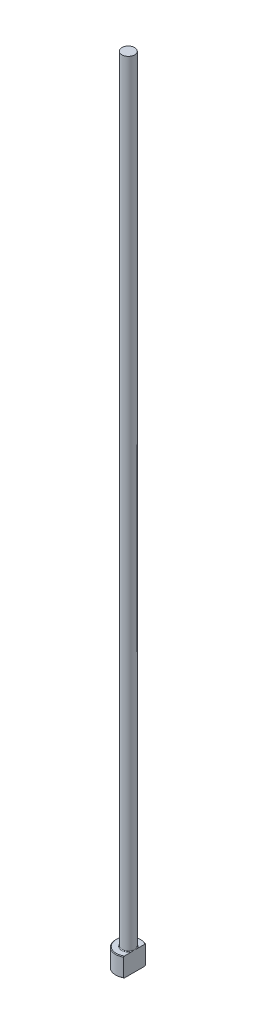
ISO-10303-21;
HEADER;
FILE_DESCRIPTION(('STEP AP214'),'2;1');
FILE_NAME('part.step','',(''),(''),'','','');
FILE_SCHEMA(('AUTOMOTIVE_DESIGN { 1 0 10303 214 1 1 1 1 }'));
ENDSEC;
DATA;
#1=APPLICATION_CONTEXT('core data for automotive mechanical design processes');
#2=APPLICATION_PROTOCOL_DEFINITION('international standard','automotive_design',2000,#1);
#3=PRODUCT_CONTEXT('',#1,'mechanical');
#4=PRODUCT('Part','Part','',(#3));
#5=PRODUCT_RELATED_PRODUCT_CATEGORY('part','',(#4));
#6=PRODUCT_DEFINITION_FORMATION('','',#4);
#7=PRODUCT_DEFINITION_CONTEXT('part definition',#1,'design');
#8=PRODUCT_DEFINITION('design','',#6,#7);
#9=PRODUCT_DEFINITION_SHAPE('','',#8);
#10=(LENGTH_UNIT() NAMED_UNIT(*) SI_UNIT(.MILLI.,.METRE.));
#11=(NAMED_UNIT(*) PLANE_ANGLE_UNIT() SI_UNIT($,.RADIAN.));
#12=(NAMED_UNIT(*) SI_UNIT($,.STERADIAN.) SOLID_ANGLE_UNIT());
#13=UNCERTAINTY_MEASURE_WITH_UNIT(LENGTH_MEASURE(1.E-05),#10,'distance_accuracy_value','');
#14=(GEOMETRIC_REPRESENTATION_CONTEXT(3) GLOBAL_UNCERTAINTY_ASSIGNED_CONTEXT((#13)) GLOBAL_UNIT_ASSIGNED_CONTEXT((#10,
#11,#12)) REPRESENTATION_CONTEXT('',''));
#15=CARTESIAN_POINT('',(0.,0.,0.));
#16=DIRECTION('',(0.,0.,1.));
#17=DIRECTION('',(1.,0.,0.));
#18=AXIS2_PLACEMENT_3D('',#15,#16,#17);
#19=CARTESIAN_POINT('',(0.,0.,0.));
#20=DIRECTION('',(0.,-1.,0.));
#21=DIRECTION('',(0.,0.,-1.));
#22=AXIS2_PLACEMENT_3D('',#19,#20,#21);
#23=PLANE('',#22);
#24=CARTESIAN_POINT('',(0.,0.,0.));
#25=DIRECTION('',(0.,-1.,0.));
#26=DIRECTION('',(0.,0.,-1.));
#27=AXIS2_PLACEMENT_3D('',#24,#25,#26);
#28=CIRCLE('',#27,3.79999999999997);
#29=CARTESIAN_POINT('',(1.99999999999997,0.,3.23109888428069));
#30=VERTEX_POINT('',#29);
#31=CARTESIAN_POINT('',(1.99999999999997,0.,-3.23109888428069));
#32=VERTEX_POINT('',#31);
#33=EDGE_CURVE('E98',#30,#32,#28,.T.);
#34=ORIENTED_EDGE('',*,*,#33,.T.);
#35=DIRECTION('',(0.,0.,1.));
#36=VECTOR('',#35,1.);
#37=CARTESIAN_POINT('',(1.99999999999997,0.,3.46410161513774));
#38=LINE('',#37,#36);
#39=EDGE_CURVE('E83',#32,#30,#38,.T.);
#40=ORIENTED_EDGE('',*,*,#39,.T.);
#41=EDGE_LOOP('',(#34,#40));
#42=FACE_BOUND('',#41,.T.);
#43=ADVANCED_FACE('F32',(#42),#23,.T.);
#44=CARTESIAN_POINT('',(0.,259.958771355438,0.));
#45=DIRECTION('',(0.,1.,0.));
#46=DIRECTION('',(0.,0.,1.));
#47=AXIS2_PLACEMENT_3D('',#44,#45,#46);
#48=CYLINDRICAL_SURFACE('',#47,3.99999999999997);
#49=CARTESIAN_POINT('',(0.,5.79999999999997,0.));
#50=DIRECTION('',(0.,1.,0.));
#51=DIRECTION('',(0.,0.,1.));
#52=AXIS2_PLACEMENT_3D('',#49,#50,#51);
#53=CIRCLE('',#52,3.99999999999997);
#54=CARTESIAN_POINT('',(1.99999999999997,5.79999999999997,3.46410161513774));
#55=VERTEX_POINT('',#54);
#56=CARTESIAN_POINT('',(1.99999999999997,5.79999999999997,-3.46410161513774));
#57=VERTEX_POINT('',#56);
#58=EDGE_CURVE('E104',#55,#57,#53,.F.);
#59=ORIENTED_EDGE('',*,*,#58,.T.);
#60=DIRECTION('',(0.,-1.,0.));
#61=VECTOR('',#60,1.);
#62=CARTESIAN_POINT('',(1.99999999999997,250.,-3.46410161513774));
#63=LINE('',#62,#61);
#64=CARTESIAN_POINT('',(1.99999999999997,0.200000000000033,-3.46410161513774));
#65=VERTEX_POINT('',#64);
#66=EDGE_CURVE('E183',#57,#65,#63,.T.);
#67=ORIENTED_EDGE('',*,*,#66,.T.);
#68=CARTESIAN_POINT('',(0.,0.200000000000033,0.));
#69=DIRECTION('',(0.,-1.,0.));
#70=DIRECTION('',(0.,0.,-1.));
#71=AXIS2_PLACEMENT_3D('',#68,#69,#70);
#72=CIRCLE('',#71,3.99999999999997);
#73=CARTESIAN_POINT('',(1.99999999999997,0.200000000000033,3.46410161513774));
#74=VERTEX_POINT('',#73);
#75=EDGE_CURVE('E100',#65,#74,#72,.F.);
#76=ORIENTED_EDGE('',*,*,#75,.T.);
#77=DIRECTION('',(0.,-1.,0.));
#78=VECTOR('',#77,1.);
#79=CARTESIAN_POINT('',(1.99999999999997,250.,3.46410161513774));
#80=LINE('',#79,#78);
#81=EDGE_CURVE('E93',#55,#74,#80,.T.);
#82=ORIENTED_EDGE('',*,*,#81,.F.);
#83=EDGE_LOOP('',(#59,#67,#76,#82));
#84=FACE_BOUND('',#83,.T.);
#85=ADVANCED_FACE('F158',(#84),#48,.T.);
#86=CARTESIAN_POINT('',(-3.99999999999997,6.,0.));
#87=DIRECTION('',(0.,1.,0.));
#88=DIRECTION('',(0.,0.,1.));
#89=AXIS2_PLACEMENT_3D('',#86,#87,#88);
#90=PLANE('',#89);
#91=CARTESIAN_POINT('',(0.,6.,0.));
#92=DIRECTION('',(0.,1.,0.));
#93=DIRECTION('',(0.,0.,1.));
#94=AXIS2_PLACEMENT_3D('',#91,#92,#93);
#95=CIRCLE('',#94,3.79999999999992);
#96=CARTESIAN_POINT('',(1.99999999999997,6.,-3.23109888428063));
#97=VERTEX_POINT('',#96);
#98=CARTESIAN_POINT('',(1.99999999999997,6.,3.23109888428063));
#99=VERTEX_POINT('',#98);
#100=EDGE_CURVE('E178',#97,#99,#95,.T.);
#101=ORIENTED_EDGE('',*,*,#100,.T.);
#102=DIRECTION('',(0.,0.,-1.));
#103=VECTOR('',#102,1.);
#104=CARTESIAN_POINT('',(1.99999999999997,6.,0.));
#105=LINE('',#104,#103);
#106=CARTESIAN_POINT('',(1.99999999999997,5.99999999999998,0.916515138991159));
#107=VERTEX_POINT('',#106);
#108=EDGE_CURVE('E57',#99,#107,#105,.T.);
#109=ORIENTED_EDGE('',*,*,#108,.T.);
#110=CARTESIAN_POINT('',(0.,6.,0.));
#111=DIRECTION('',(0.,1.,0.));
#112=DIRECTION('',(0.,0.,1.));
#113=AXIS2_PLACEMENT_3D('',#110,#111,#112);
#114=CIRCLE('',#113,2.19999999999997);
#115=CARTESIAN_POINT('',(1.99999999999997,5.99999999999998,-0.916515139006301));
#116=VERTEX_POINT('',#115);
#117=EDGE_CURVE('E107',#107,#116,#114,.F.);
#118=ORIENTED_EDGE('',*,*,#117,.T.);
#119=EDGE_CURVE('E136',#116,#97,#105,.T.);
#120=ORIENTED_EDGE('',*,*,#119,.T.);
#121=EDGE_LOOP('',(#101,#109,#118,#120));
#122=FACE_BOUND('',#121,.T.);
#123=ADVANCED_FACE('F147',(#122),#90,.T.);
#124=CARTESIAN_POINT('',(0.,6.00000000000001,0.));
#125=DIRECTION('',(0.,-1.,0.));
#126=DIRECTION('',(0.,0.,-1.));
#127=AXIS2_PLACEMENT_3D('',#124,#125,#126);
#128=CONICAL_SURFACE('',#127,3.79999999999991,0.785398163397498);
#129=ORIENTED_EDGE('',*,*,#58,.F.);
#130=CARTESIAN_POINT('',(1.99999999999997,1.91904532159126,7.62295524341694));
#131=CARTESIAN_POINT('',(1.99999999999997,2.0861124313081,7.45022392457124));
#132=CARTESIAN_POINT('',(1.99999999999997,2.25300024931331,7.27731861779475));
#133=CARTESIAN_POINT('',(1.99999999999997,2.58631125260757,6.93105655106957));
#134=CARTESIAN_POINT('',(1.99999999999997,2.75273443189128,6.75769978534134));
#135=CARTESIAN_POINT('',(1.99999999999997,3.08509080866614,6.4103469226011));
#136=CARTESIAN_POINT('',(1.99999999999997,3.25102371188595,6.23635054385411));
#137=CARTESIAN_POINT('',(1.99999999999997,3.58215598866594,5.88766284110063));
#138=CARTESIAN_POINT('',(1.99999999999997,3.74735536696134,5.71297152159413));
#139=CARTESIAN_POINT('',(1.99999999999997,4.0735385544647,5.36616839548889));
#140=CARTESIAN_POINT('',(1.99999999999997,4.23454099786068,5.19407412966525));
#141=CARTESIAN_POINT('',(1.99999999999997,4.55534102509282,4.84876663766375));
#142=CARTESIAN_POINT('',(1.99999999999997,4.7151386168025,4.67555341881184));
#143=CARTESIAN_POINT('',(1.99999999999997,5.03306183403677,4.32766569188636));
#144=CARTESIAN_POINT('',(1.99999999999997,5.19118781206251,4.15299150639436));
#145=CARTESIAN_POINT('',(1.99999999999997,5.50513944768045,3.80159134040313));
#146=CARTESIAN_POINT('',(1.99999999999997,5.66096519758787,3.62486544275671));
#147=CARTESIAN_POINT('',(1.99999999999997,5.90974646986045,3.33722425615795));
#148=CARTESIAN_POINT('',(1.99999999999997,6.00376148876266,3.22722645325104));
#149=CARTESIAN_POINT('',(1.99999999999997,6.19011825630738,3.00579987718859));
#150=CARTESIAN_POINT('',(1.99999999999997,6.28245983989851,2.89437096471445));
#151=CARTESIAN_POINT('',(1.99999999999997,6.46586188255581,2.66849662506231));
#152=CARTESIAN_POINT('',(1.99999999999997,6.55689849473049,2.55403176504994));
#153=CARTESIAN_POINT('',(1.99999999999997,6.7357880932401,2.32266819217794));
#154=CARTESIAN_POINT('',(1.99999999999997,6.82364184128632,2.20577007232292));
#155=CARTESIAN_POINT('',(1.99999999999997,6.9961275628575,1.96688707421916));
#156=CARTESIAN_POINT('',(1.99999999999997,7.08069035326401,1.84485190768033));
#157=CARTESIAN_POINT('',(1.99999999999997,7.24300264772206,1.59599329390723));
#158=CARTESIAN_POINT('',(1.99999999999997,7.32074277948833,1.4691635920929));
#159=CARTESIAN_POINT('',(1.99999999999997,7.42869763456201,1.27510066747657));
#160=CARTESIAN_POINT('',(1.99999999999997,7.46305374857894,1.21018943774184));
#161=CARTESIAN_POINT('',(1.99999999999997,7.5283714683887,1.07868835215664));
#162=CARTESIAN_POINT('',(1.99999999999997,7.55933245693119,1.01209819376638));
#163=CARTESIAN_POINT('',(1.99999999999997,7.64566860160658,0.809894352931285));
#164=CARTESIAN_POINT('',(1.99999999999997,7.69478214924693,0.671360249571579));
#165=CARTESIAN_POINT('',(1.99999999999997,7.74794829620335,0.463657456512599));
#166=CARTESIAN_POINT('',(1.99999999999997,7.76205065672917,0.397033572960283));
#167=CARTESIAN_POINT('',(1.99999999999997,7.78390371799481,0.262728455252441));
#168=CARTESIAN_POINT('',(1.99999999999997,7.7916549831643,0.195047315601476));
#169=CARTESIAN_POINT('',(1.99999999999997,7.80025690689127,0.0594528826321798));
#170=CARTESIAN_POINT('',(1.99999999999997,7.80112894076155,-0.00845903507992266));
#171=CARTESIAN_POINT('',(1.99999999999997,7.79596585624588,-0.144020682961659));
#172=CARTESIAN_POINT('',(1.99999999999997,7.78993016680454,-0.211670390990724));
#173=CARTESIAN_POINT('',(1.99999999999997,7.7714536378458,-0.345483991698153));
#174=CARTESIAN_POINT('',(1.99999999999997,7.75906777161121,-0.41165563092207));
#175=CARTESIAN_POINT('',(1.99999999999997,7.72866360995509,-0.54267826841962));
#176=CARTESIAN_POINT('',(1.99999999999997,7.71064463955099,-0.607529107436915));
#177=CARTESIAN_POINT('',(1.99999999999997,7.66972939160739,-0.736064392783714));
#178=CARTESIAN_POINT('',(1.99999999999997,7.64680564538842,-0.799739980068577));
#179=CARTESIAN_POINT('',(1.99999999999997,7.59700147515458,-0.925489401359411));
#180=CARTESIAN_POINT('',(1.99999999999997,7.57012185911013,-0.987563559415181));
#181=CARTESIAN_POINT('',(1.99999999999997,7.4844351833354,-1.17209020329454));
#182=CARTESIAN_POINT('',(1.99999999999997,7.42077407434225,-1.29228210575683));
#183=CARTESIAN_POINT('',(1.99999999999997,7.28502644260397,-1.5278577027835));
#184=CARTESIAN_POINT('',(1.99999999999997,7.21292931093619,-1.64323509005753));
#185=CARTESIAN_POINT('',(1.99999999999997,7.06281517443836,-1.87069387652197));
#186=CARTESIAN_POINT('',(1.99999999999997,6.98477595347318,-1.98276048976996));
#187=CARTESIAN_POINT('',(1.99999999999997,6.82481971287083,-2.20397837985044));
#188=CARTESIAN_POINT('',(1.99999999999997,6.74290465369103,-2.31313108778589));
#189=CARTESIAN_POINT('',(1.99999999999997,6.5751722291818,-2.5306854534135));
#190=CARTESIAN_POINT('',(1.99999999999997,6.48931769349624,-2.6390583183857));
#191=CARTESIAN_POINT('',(1.99999999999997,6.31548151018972,-2.85409686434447));
#192=CARTESIAN_POINT('',(1.99999999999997,6.22749963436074,-2.96076236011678));
#193=CARTESIAN_POINT('',(1.99999999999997,6.0501503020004,-3.1724921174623));
#194=CARTESIAN_POINT('',(1.99999999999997,5.96078672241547,-3.27755963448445));
#195=CARTESIAN_POINT('',(1.99999999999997,5.78082366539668,-3.48663191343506));
#196=CARTESIAN_POINT('',(1.99999999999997,5.69022416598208,-3.59063665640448));
#197=CARTESIAN_POINT('',(1.99999999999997,5.4479673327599,-3.86612439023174));
#198=CARTESIAN_POINT('',(1.99999999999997,5.29545972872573,-4.03685912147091));
#199=CARTESIAN_POINT('',(1.99999999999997,4.98858070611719,-4.37664803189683));
#200=CARTESIAN_POINT('',(1.99999999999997,4.83420923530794,-4.54570216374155));
#201=CARTESIAN_POINT('',(1.99999999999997,4.52396102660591,-4.88271638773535));
#202=CARTESIAN_POINT('',(1.99999999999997,4.36808300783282,-5.05067529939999));
#203=CARTESIAN_POINT('',(1.99999999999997,4.05530513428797,-5.38563883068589));
#204=CARTESIAN_POINT('',(1.99999999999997,3.89840527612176,-5.5526434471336));
#205=CARTESIAN_POINT('',(1.99999999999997,3.59029018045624,-5.87905385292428));
#206=CARTESIAN_POINT('',(1.99999999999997,3.43910664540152,-6.03848959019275));
#207=CARTESIAN_POINT('',(1.99999999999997,3.13616436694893,-6.35681456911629));
#208=CARTESIAN_POINT('',(1.99999999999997,2.98440562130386,-6.5157038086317));
#209=CARTESIAN_POINT('',(1.99999999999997,2.6805950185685,-6.83286192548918));
#210=CARTESIAN_POINT('',(1.99999999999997,2.52854367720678,-6.99113129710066));
#211=CARTESIAN_POINT('',(1.99999999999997,2.22406035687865,-7.30730102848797));
#212=CARTESIAN_POINT('',(1.99999999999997,2.07162838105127,-7.46520139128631));
#213=CARTESIAN_POINT('',(1.99999999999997,1.91904532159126,-7.62295524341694));
#214=B_SPLINE_CURVE_WITH_KNOTS('',3,(#130,#131,#132,#133,#134,#135,#136,#137,#138,#139,#140,
#141,#142,#143,#144,#145,#146,#147,#148,#149,#150,#151,#152,#153,#154,#155,#156,#157,#158,#159,
#160,#161,#162,#163,#164,#165,#166,#167,#168,#169,#170,#171,#172,#173,#174,#175,#176,#177,#178,
#179,#180,#181,#182,#183,#184,#185,#186,#187,#188,#189,#190,#191,#192,#193,#194,#195,#196,#197,
#198,#199,#200,#201,#202,#203,#204,#205,#206,#207,#208,#209,#210,#211,#212,#213),.UNSPECIFIED.,
.F.,.F.,(4,2,2,2,2,2,2,2,2,2,2,2,2,2,2,2,2,2,2,2,2,2,2,2,2,2,2,2,2,2,2,2,2,2,2,2,2,2,2,2,2,4),
(0.,0.720921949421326,1.44185317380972,2.16315326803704,2.88444869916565,3.59144103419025,
4.29842874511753,5.00526427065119,5.71207135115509,6.14616174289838,6.58029471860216,
7.01901494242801,7.45762947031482,7.90290456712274,8.34878206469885,8.56901415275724,
8.78928621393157,9.2281447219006,9.4321951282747,9.63622739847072,9.83962544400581,
10.0430403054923,10.24472322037,10.4464303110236,10.6492980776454,10.8521244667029,
11.2595582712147,11.6675100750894,12.0770700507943,12.4864250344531,12.9011677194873,
13.3159550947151,13.7297367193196,14.1435257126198,14.8302935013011,15.5170805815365,
16.204514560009,16.8919508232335,17.5511045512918,18.2102608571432,18.8686819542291,
19.5270976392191),.UNSPECIFIED.);
#215=EDGE_CURVE('E135',#55,#99,#214,.T.);
#216=ORIENTED_EDGE('',*,*,#215,.T.);
#217=ORIENTED_EDGE('',*,*,#100,.F.);
#218=EDGE_CURVE('E127',#97,#57,#214,.T.);
#219=ORIENTED_EDGE('',*,*,#218,.T.);
#220=EDGE_LOOP('',(#129,#216,#217,#219));
#221=FACE_BOUND('',#220,.T.);
#222=ADVANCED_FACE('F143',(#221),#128,.T.);
#223=CARTESIAN_POINT('',(0.,0.200000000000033,0.));
#224=DIRECTION('',(0.,1.,0.));
#225=DIRECTION('',(0.,0.,1.));
#226=AXIS2_PLACEMENT_3D('',#223,#224,#225);
#227=CONICAL_SURFACE('',#226,3.99999999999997,0.785398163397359);
#228=ORIENTED_EDGE('',*,*,#75,.F.);
#229=CARTESIAN_POINT('',(1.99999999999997,4.08095467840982,-7.62295524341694));
#230=CARTESIAN_POINT('',(1.99999999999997,3.91388756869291,-7.4502239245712));
#231=CARTESIAN_POINT('',(1.99999999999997,3.74699975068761,-7.27731861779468));
#232=CARTESIAN_POINT('',(1.99999999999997,3.4136887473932,-6.93105655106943));
#233=CARTESIAN_POINT('',(1.99999999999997,3.2472655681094,-6.75769978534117));
#234=CARTESIAN_POINT('',(1.99999999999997,2.91490919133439,-6.41034692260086));
#235=CARTESIAN_POINT('',(1.99999999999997,2.7489762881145,-6.23635054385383));
#236=CARTESIAN_POINT('',(1.99999999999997,2.41784401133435,-5.88766284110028));
#237=CARTESIAN_POINT('',(1.99999999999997,2.25264463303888,-5.71297152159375));
#238=CARTESIAN_POINT('',(1.99999999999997,1.92646144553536,-5.36616839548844));
#239=CARTESIAN_POINT('',(1.99999999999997,1.76545900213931,-5.19407412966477));
#240=CARTESIAN_POINT('',(1.99999999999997,1.44465897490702,-4.8487666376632));
#241=CARTESIAN_POINT('',(1.99999999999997,1.28486138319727,-4.67555341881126));
#242=CARTESIAN_POINT('',(1.99999999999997,0.966938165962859,-4.32766569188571));
#243=CARTESIAN_POINT('',(1.99999999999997,0.808812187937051,-4.15299150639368));
#244=CARTESIAN_POINT('',(1.99999999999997,0.494860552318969,-3.80159134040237));
#245=CARTESIAN_POINT('',(1.99999999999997,0.339034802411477,-3.62486544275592));
#246=CARTESIAN_POINT('',(1.99999999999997,0.0902535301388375,-3.33722425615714));
#247=CARTESIAN_POINT('',(1.99999999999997,-0.00376148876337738,-3.22722645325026));
#248=CARTESIAN_POINT('',(1.99999999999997,-0.190118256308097,-3.00579987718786));
#249=CARTESIAN_POINT('',(1.99999999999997,-0.282459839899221,-2.89437096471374));
#250=CARTESIAN_POINT('',(1.99999999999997,-0.465861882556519,-2.66849662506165));
#251=CARTESIAN_POINT('',(1.99999999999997,-0.556898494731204,-2.5540317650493));
#252=CARTESIAN_POINT('',(1.99999999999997,-0.735788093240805,-2.32266819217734));
#253=CARTESIAN_POINT('',(1.99999999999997,-0.823641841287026,-2.20577007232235));
#254=CARTESIAN_POINT('',(1.99999999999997,-0.9961275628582,-1.96688707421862));
#255=CARTESIAN_POINT('',(1.99999999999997,-1.08069035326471,-1.84485190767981));
#256=CARTESIAN_POINT('',(1.99999999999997,-1.24300264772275,-1.59599329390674));
#257=CARTESIAN_POINT('',(1.99999999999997,-1.32074277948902,-1.46916359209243));
#258=CARTESIAN_POINT('',(1.99999999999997,-1.42869763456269,-1.27510066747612));
#259=CARTESIAN_POINT('',(1.99999999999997,-1.46305374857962,-1.21018943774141));
#260=CARTESIAN_POINT('',(1.99999999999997,-1.52837146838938,-1.07868835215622));
#261=CARTESIAN_POINT('',(1.99999999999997,-1.55933245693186,-1.01209819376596));
#262=CARTESIAN_POINT('',(1.99999999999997,-1.64566860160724,-0.809894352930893));
#263=CARTESIAN_POINT('',(1.99999999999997,-1.69478214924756,-0.671360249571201));
#264=CARTESIAN_POINT('',(1.99999999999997,-1.74794829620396,-0.463657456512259));
#265=CARTESIAN_POINT('',(1.99999999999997,-1.76205065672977,-0.397033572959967));
#266=CARTESIAN_POINT('',(1.99999999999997,-1.78390371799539,-0.262728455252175));
#267=CARTESIAN_POINT('',(1.99999999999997,-1.79165498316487,-0.195047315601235));
#268=CARTESIAN_POINT('',(1.99999999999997,-1.80025690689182,-0.0594528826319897));
#269=CARTESIAN_POINT('',(1.99999999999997,-1.8011289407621,0.00845903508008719));
#270=CARTESIAN_POINT('',(1.99999999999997,-1.79596585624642,0.144020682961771));
#271=CARTESIAN_POINT('',(1.99999999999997,-1.78993016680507,0.21167039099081));
#272=CARTESIAN_POINT('',(1.99999999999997,-1.77145363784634,0.345483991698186));
#273=CARTESIAN_POINT('',(1.99999999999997,-1.75906777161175,0.411655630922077));
#274=CARTESIAN_POINT('',(1.99999999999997,-1.72866360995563,0.542678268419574));
#275=CARTESIAN_POINT('',(1.99999999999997,-1.71064463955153,0.607529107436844));
#276=CARTESIAN_POINT('',(1.99999999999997,-1.66972939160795,0.736064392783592));
#277=CARTESIAN_POINT('',(1.99999999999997,-1.64680564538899,0.799739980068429));
#278=CARTESIAN_POINT('',(1.99999999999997,-1.59700147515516,0.925489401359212));
#279=CARTESIAN_POINT('',(1.99999999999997,-1.57012185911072,0.987563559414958));
#280=CARTESIAN_POINT('',(1.99999999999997,-1.48443518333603,1.17209020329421));
#281=CARTESIAN_POINT('',(1.99999999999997,-1.42077407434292,1.29228210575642));
#282=CARTESIAN_POINT('',(1.99999999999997,-1.28502644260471,1.52785770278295));
#283=CARTESIAN_POINT('',(1.99999999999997,-1.21292931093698,1.6432350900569));
#284=CARTESIAN_POINT('',(1.99999999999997,-1.06281517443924,1.87069387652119));
#285=CARTESIAN_POINT('',(1.99999999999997,-0.984775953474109,1.98276048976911));
#286=CARTESIAN_POINT('',(1.99999999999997,-0.824819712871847,2.20397837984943));
#287=CARTESIAN_POINT('',(1.99999999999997,-0.742904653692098,2.31313108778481));
#288=CARTESIAN_POINT('',(1.99999999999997,-0.575172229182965,2.53068545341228));
#289=CARTESIAN_POINT('',(1.99999999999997,-0.489317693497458,2.63905831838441));
#290=CARTESIAN_POINT('',(1.99999999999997,-0.315481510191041,2.85409686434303));
#291=CARTESIAN_POINT('',(1.99999999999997,-0.227499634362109,2.96076236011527));
#292=CARTESIAN_POINT('',(1.99999999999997,-0.0501503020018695,3.17249211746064));
#293=CARTESIAN_POINT('',(1.99999999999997,0.0392132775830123,3.27755963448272));
#294=CARTESIAN_POINT('',(1.99999999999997,0.219176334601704,3.48663191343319));
#295=CARTESIAN_POINT('',(1.99999999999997,0.309775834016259,3.59063665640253));
#296=CARTESIAN_POINT('',(1.99999999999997,0.552032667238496,3.86612439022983));
#297=CARTESIAN_POINT('',(1.99999999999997,0.704540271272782,4.0368591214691));
#298=CARTESIAN_POINT('',(1.99999999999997,1.01141929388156,4.37664803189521));
#299=CARTESIAN_POINT('',(1.99999999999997,1.16579076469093,4.54570216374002));
#300=CARTESIAN_POINT('',(1.99999999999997,1.47603897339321,4.88271638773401));
#301=CARTESIAN_POINT('',(1.99999999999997,1.63191699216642,5.05067529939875));
#302=CARTESIAN_POINT('',(1.99999999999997,1.94469486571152,5.38563883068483));
#303=CARTESIAN_POINT('',(1.99999999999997,2.10159472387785,5.55264344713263));
#304=CARTESIAN_POINT('',(1.99999999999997,2.40970981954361,5.87905385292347));
#305=CARTESIAN_POINT('',(1.99999999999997,2.56089335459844,6.03848959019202));
#306=CARTESIAN_POINT('',(1.99999999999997,2.86383563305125,6.3568145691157));
#307=CARTESIAN_POINT('',(1.99999999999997,3.01559437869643,6.51570380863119));
#308=CARTESIAN_POINT('',(1.99999999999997,3.31940498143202,6.83286192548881));
#309=CARTESIAN_POINT('',(1.99999999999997,3.47145632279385,6.99113129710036));
#310=CARTESIAN_POINT('',(1.99999999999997,3.77593964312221,7.30730102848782));
#311=CARTESIAN_POINT('',(1.99999999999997,3.9283716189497,7.46520139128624));
#312=CARTESIAN_POINT('',(1.99999999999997,4.08095467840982,7.62295524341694));
#313=B_SPLINE_CURVE_WITH_KNOTS('',3,(#229,#230,#231,#232,#233,#234,#235,#236,#237,#238,#239,
#240,#241,#242,#243,#244,#245,#246,#247,#248,#249,#250,#251,#252,#253,#254,#255,#256,#257,#258,
#259,#260,#261,#262,#263,#264,#265,#266,#267,#268,#269,#270,#271,#272,#273,#274,#275,#276,#277,
#278,#279,#280,#281,#282,#283,#284,#285,#286,#287,#288,#289,#290,#291,#292,#293,#294,#295,#296,
#297,#298,#299,#300,#301,#302,#303,#304,#305,#306,#307,#308,#309,#310,#311,#312),.UNSPECIFIED.,
.F.,.F.,(4,2,2,2,2,2,2,2,2,2,2,2,2,2,2,2,2,2,2,2,2,2,2,2,2,2,2,2,2,2,2,2,2,2,2,2,2,2,2,2,2,4),
(0.,0.720921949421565,1.4418531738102,2.16315326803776,2.88444869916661,3.59144103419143,
4.29842874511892,5.00526427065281,5.71207135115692,6.14616174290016,6.58029471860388,
7.01901494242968,7.45762947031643,7.90290456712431,8.34878206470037,8.56901415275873,
8.78928621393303,9.22814472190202,9.43219512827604,9.63622739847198,9.83962544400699,
10.0430403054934,10.244723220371,10.4464303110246,10.6492980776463,10.8521244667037,
11.2595582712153,11.6675100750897,12.0770700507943,12.4864250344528,12.9011677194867,
13.3159550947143,13.7297367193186,14.1435257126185,14.8302935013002,15.5170805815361,
16.2045145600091,16.891950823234,17.5511045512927,18.2102608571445,18.8686819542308,
19.5270976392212),.UNSPECIFIED.);
#314=EDGE_CURVE('E86',#65,#32,#313,.T.);
#315=ORIENTED_EDGE('',*,*,#314,.T.);
#316=ORIENTED_EDGE('',*,*,#33,.F.);
#317=EDGE_CURVE('E89',#30,#74,#313,.T.);
#318=ORIENTED_EDGE('',*,*,#317,.T.);
#319=EDGE_LOOP('',(#228,#315,#316,#318));
#320=FACE_BOUND('',#319,.T.);
#321=ADVANCED_FACE('F97',(#320),#227,.T.);
#322=CARTESIAN_POINT('',(0.,6.19999999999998,0.));
#323=DIRECTION('',(0.,1.,0.));
#324=DIRECTION('',(0.,0.,1.));
#325=AXIS2_PLACEMENT_3D('',#322,#323,#324);
#326=TOROIDAL_SURFACE('',#325,2.19999999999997,0.2);
#327=CARTESIAN_POINT('',(1.99999999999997,6.19999999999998,0.));
#328=CARTESIAN_POINT('',(1.99999999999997,6.20000050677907,1.13930141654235E-10));
#329=CARTESIAN_POINT('',(1.99999999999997,6.20000101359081,-1.46766795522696E-07));
#330=CARTESIAN_POINT('',(1.99999999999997,6.20000197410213,-5.82067451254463E-07));
#331=CARTESIAN_POINT('',(1.99999999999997,6.20000242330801,-8.77873018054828E-07));
#332=CARTESIAN_POINT('',(1.99999999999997,6.2000033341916,-1.5842451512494E-06));
#333=CARTESIAN_POINT('',(1.99999999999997,6.20000378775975,-2.00534283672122E-06));
#334=CARTESIAN_POINT('',(1.99999999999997,6.20000462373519,-2.89558841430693E-06));
#335=CARTESIAN_POINT('',(1.99999999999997,6.20000500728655,-3.36372325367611E-06));
#336=CARTESIAN_POINT('',(1.99999999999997,6.20000636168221,-5.10887550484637E-06));
#337=CARTESIAN_POINT('',(1.99999999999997,6.20000725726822,-6.44597279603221E-06));
#338=CARTESIAN_POINT('',(1.99999999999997,6.20000879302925,-9.14926716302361E-06));
#339=CARTESIAN_POINT('',(1.99999999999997,6.20000944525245,-1.0508971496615E-05));
#340=CARTESIAN_POINT('',(1.99999999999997,6.20001204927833,-1.60555880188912E-05));
#341=CARTESIAN_POINT('',(1.99999999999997,6.20001390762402,-2.02908747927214E-05));
#342=CARTESIAN_POINT('',(1.99999999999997,6.20001676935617,-2.84438494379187E-05));
#343=CARTESIAN_POINT('',(1.99999999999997,6.20001785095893,-3.23343259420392E-05));
#344=CARTESIAN_POINT('',(1.99999999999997,6.20002551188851,-6.06027145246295E-05));
#345=CARTESIAN_POINT('',(1.99999999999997,6.20003111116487,-8.51991847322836E-05));
#346=CARTESIAN_POINT('',(1.99999999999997,6.20005559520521,-0.00018156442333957));
#347=CARTESIAN_POINT('',(1.99999999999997,6.20007914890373,-0.000252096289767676));
#348=CARTESIAN_POINT('',(1.99999999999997,6.20017002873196,-0.00052958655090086));
#349=CARTESIAN_POINT('',(1.99999999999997,6.20023415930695,-0.00073729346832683));
#350=CARTESIAN_POINT('',(1.99999999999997,6.20048926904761,-0.00155657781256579));
#351=CARTESIAN_POINT('',(1.99999999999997,6.20068414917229,-0.00216722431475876));
#352=CARTESIAN_POINT('',(1.99999999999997,6.20148805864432,-0.0046938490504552));
#353=CARTESIAN_POINT('',(1.99999999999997,6.20209226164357,-0.00661098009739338));
#354=CARTESIAN_POINT('',(1.99999999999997,6.20822779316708,-0.026069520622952));
#355=CARTESIAN_POINT('',(1.99999999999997,6.21378174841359,-0.0436057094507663));
#356=CARTESIAN_POINT('',(1.99999999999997,6.22462834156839,-0.0780127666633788));
#357=CARTESIAN_POINT('',(1.99999999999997,6.22992277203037,-0.0948831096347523));
#358=CARTESIAN_POINT('',(1.99999999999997,6.24110477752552,-0.130713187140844));
#359=CARTESIAN_POINT('',(1.99999999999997,6.24698536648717,-0.149675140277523));
#360=CARTESIAN_POINT('',(1.99999999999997,6.25869835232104,-0.187834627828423));
#361=CARTESIAN_POINT('',(1.99999999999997,6.26452957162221,-0.207032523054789));
#362=CARTESIAN_POINT('',(1.99999999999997,6.27861584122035,-0.254071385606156));
#363=CARTESIAN_POINT('',(1.99999999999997,6.28678835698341,-0.281937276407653));
#364=CARTESIAN_POINT('',(1.99999999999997,6.30249503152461,-0.33711523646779));
#365=CARTESIAN_POINT('',(1.99999999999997,6.31003989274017,-0.364424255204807));
#366=CARTESIAN_POINT('',(1.99999999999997,6.32554795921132,-0.422841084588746));
#367=CARTESIAN_POINT('',(1.99999999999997,6.33343288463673,-0.453970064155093));
#368=CARTESIAN_POINT('',(1.99999999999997,6.34833120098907,-0.516667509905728));
#369=CARTESIAN_POINT('',(1.99999999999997,6.3553379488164,-0.548237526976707));
#370=CARTESIAN_POINT('',(1.99999999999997,6.37554978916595,-0.647984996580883));
#371=CARTESIAN_POINT('',(1.99999999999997,6.38665117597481,-0.716635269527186));
#372=CARTESIAN_POINT('',(1.99999999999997,6.39785773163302,-0.8324457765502));
#373=CARTESIAN_POINT('',(1.99999999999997,6.40036304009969,-0.879345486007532));
#374=CARTESIAN_POINT('',(1.99999999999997,6.39976024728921,-0.949238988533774));
#375=CARTESIAN_POINT('',(1.99999999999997,6.39886048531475,-0.97224857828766));
#376=CARTESIAN_POINT('',(1.99999999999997,6.39534463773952,-1.01812773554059));
#377=CARTESIAN_POINT('',(1.99999999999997,6.39273014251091,-1.04099741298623));
#378=CARTESIAN_POINT('',(1.99999999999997,6.38623968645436,-1.08102660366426));
#379=CARTESIAN_POINT('',(1.99999999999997,6.38280841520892,-1.09825717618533));
#380=CARTESIAN_POINT('',(1.99999999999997,6.37442567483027,-1.13243508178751));
#381=CARTESIAN_POINT('',(1.99999999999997,6.36946777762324,-1.14938089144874));
#382=CARTESIAN_POINT('',(1.99999999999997,6.35764172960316,-1.18276398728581));
#383=CARTESIAN_POINT('',(1.99999999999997,6.35075810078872,-1.1991959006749));
#384=CARTESIAN_POINT('',(1.99999999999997,6.33462082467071,-1.23083581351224));
#385=CARTESIAN_POINT('',(1.99999999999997,6.32537783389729,-1.24604892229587));
#386=CARTESIAN_POINT('',(1.99999999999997,6.30929159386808,-1.26715296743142));
#387=CARTESIAN_POINT('',(1.99999999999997,6.303567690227,-1.27389441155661));
#388=CARTESIAN_POINT('',(1.99999999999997,6.29128925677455,-1.28659894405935));
#389=CARTESIAN_POINT('',(1.99999999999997,6.28473413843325,-1.29256147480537));
#390=CARTESIAN_POINT('',(1.99999999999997,6.27066594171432,-1.30346436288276));
#391=CARTESIAN_POINT('',(1.99999999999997,6.26314132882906,-1.30839014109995));
#392=CARTESIAN_POINT('',(1.99999999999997,6.24727957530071,-1.31668687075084));
#393=CARTESIAN_POINT('',(1.99999999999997,6.23894498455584,-1.32006252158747));
#394=CARTESIAN_POINT('',(1.99999999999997,6.22424089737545,-1.3241557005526));
#395=CARTESIAN_POINT('',(1.99999999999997,6.21800630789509,-1.32536112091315));
#396=CARTESIAN_POINT('',(1.99999999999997,6.20542266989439,-1.32669615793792));
#397=CARTESIAN_POINT('',(1.99999999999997,6.19907368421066,-1.32682634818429));
#398=CARTESIAN_POINT('',(1.99999999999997,6.18645152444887,-1.32599950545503));
#399=CARTESIAN_POINT('',(1.99999999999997,6.18017831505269,-1.32504300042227));
#400=CARTESIAN_POINT('',(1.99999999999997,6.16787181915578,-1.32212308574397));
#401=CARTESIAN_POINT('',(1.99999999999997,6.16183869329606,-1.32015901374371));
#402=CARTESIAN_POINT('',(1.99999999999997,6.14844260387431,-1.31466566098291));
#403=CARTESIAN_POINT('',(1.99999999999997,6.14119825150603,-1.3108482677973));
#404=CARTESIAN_POINT('',(1.99999999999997,6.12742328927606,-1.30209252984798));
#405=CARTESIAN_POINT('',(1.99999999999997,6.12089414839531,-1.29715193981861));
#406=CARTESIAN_POINT('',(1.99999999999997,6.10554761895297,-1.28382084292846));
#407=CARTESIAN_POINT('',(1.99999999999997,6.09717242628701,-1.27492468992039));
#408=CARTESIAN_POINT('',(1.99999999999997,6.08188323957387,-1.25597903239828));
#409=CARTESIAN_POINT('',(1.99999999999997,6.07497120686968,-1.24592800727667));
#410=CARTESIAN_POINT('',(1.99999999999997,6.05771073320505,-1.21734573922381));
#411=CARTESIAN_POINT('',(1.99999999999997,6.04862251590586,-1.19806017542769));
#412=CARTESIAN_POINT('',(1.99999999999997,6.03323781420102,-1.15830155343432));
#413=CARTESIAN_POINT('',(1.99999999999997,6.02696471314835,-1.13782009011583));
#414=CARTESIAN_POINT('',(1.99999999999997,6.01659159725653,-1.09607450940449));
#415=CARTESIAN_POINT('',(1.99999999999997,6.01251776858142,-1.07480405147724));
#416=CARTESIAN_POINT('',(1.99999999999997,6.0061890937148,-1.03196822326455));
#417=CARTESIAN_POINT('',(1.99999999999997,6.00393768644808,-1.0104023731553));
#418=CARTESIAN_POINT('',(1.99999999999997,5.99950887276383,-0.946948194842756));
#419=CARTESIAN_POINT('',(1.99999999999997,5.99937097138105,-0.904921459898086));
#420=CARTESIAN_POINT('',(1.99999999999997,6.00391139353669,-0.800067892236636));
#421=CARTESIAN_POINT('',(1.99999999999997,6.01103947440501,-0.737378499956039));
#422=CARTESIAN_POINT('',(1.99999999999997,6.0310998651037,-0.61144432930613));
#423=CARTESIAN_POINT('',(1.99999999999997,6.04417074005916,-0.54822386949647));
#424=CARTESIAN_POINT('',(1.99999999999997,6.06920011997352,-0.442888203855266));
#425=CARTESIAN_POINT('',(1.99999999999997,6.08016343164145,-0.400527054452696));
#426=CARTESIAN_POINT('',(1.99999999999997,6.10315303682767,-0.316588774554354));
#427=CARTESIAN_POINT('',(1.99999999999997,6.11516655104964,-0.275008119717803));
#428=CARTESIAN_POINT('',(1.99999999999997,6.13853403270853,-0.196672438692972));
#429=CARTESIAN_POINT('',(1.99999999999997,6.14981294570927,-0.159894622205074));
#430=CARTESIAN_POINT('',(1.99999999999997,6.17316886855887,-0.0849211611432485));
#431=CARTESIAN_POINT('',(1.99999999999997,6.18525959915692,-0.046729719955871));
#432=CARTESIAN_POINT('',(1.99999999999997,6.1979086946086,-0.00660765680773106));
#433=CARTESIAN_POINT('',(1.99999999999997,6.19851400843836,-0.00468723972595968));
#434=CARTESIAN_POINT('',(1.99999999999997,6.199318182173,-0.00215985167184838));
#435=CARTESIAN_POINT('',(1.99999999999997,6.19951225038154,-0.0015517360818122));
#436=CARTESIAN_POINT('',(1.99999999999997,6.19976637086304,-0.000735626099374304));
#437=CARTESIAN_POINT('',(1.99999999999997,6.19983030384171,-0.000528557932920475));
#438=CARTESIAN_POINT('',(1.99999999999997,6.19992094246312,-0.00025181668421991));
#439=CARTESIAN_POINT('',(1.99999999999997,6.1999444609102,-0.000181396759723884));
#440=CARTESIAN_POINT('',(1.99999999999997,6.19996891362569,-8.51622338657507E-05));
#441=CARTESIAN_POINT('',(1.99999999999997,6.19997450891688,-6.05824645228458E-05));
#442=CARTESIAN_POINT('',(1.99999999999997,6.19998216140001,-3.23308902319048E-05));
#443=CARTESIAN_POINT('',(1.99999999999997,6.19998324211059,-2.8441435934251E-05));
#444=CARTESIAN_POINT('',(1.99999999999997,6.19998610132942,-2.02904710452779E-05));
#445=CARTESIAN_POINT('',(1.99999999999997,6.19998795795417,-1.6056119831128E-05));
#446=CARTESIAN_POINT('',(1.99999999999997,6.19999055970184,-1.05104411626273E-05));
#447=CARTESIAN_POINT('',(1.99999999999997,6.19999121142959,-9.15081317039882E-06));
#448=CARTESIAN_POINT('',(1.99999999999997,6.19999274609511,-6.44758195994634E-06));
#449=CARTESIAN_POINT('',(1.99999999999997,6.19999364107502,-5.11046373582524E-06));
#450=CARTESIAN_POINT('',(1.99999999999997,6.1999949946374,-3.36517635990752E-06));
#451=CARTESIAN_POINT('',(1.99999999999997,6.19999537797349,-2.8969795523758E-06));
#452=CARTESIAN_POINT('',(1.99999999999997,6.19999621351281,-2.00657125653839E-06));
#453=CARTESIAN_POINT('',(1.99999999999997,6.19999666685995,-1.58537196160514E-06));
#454=CARTESIAN_POINT('',(1.99999999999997,6.19999757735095,-8.78757217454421E-07));
#455=CARTESIAN_POINT('',(1.99999999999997,6.19999802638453,-5.82817893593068E-07));
#456=CARTESIAN_POINT('',(1.99999999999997,6.19999898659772,-1.47186735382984E-07));
#457=CARTESIAN_POINT('',(1.99999999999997,6.19999949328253,-1.13916285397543E-10));
#458=CARTESIAN_POINT('',(1.99999999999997,6.19999999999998,0.));
#459=B_SPLINE_CURVE_WITH_KNOTS('',3,(#327,#328,#329,#330,#331,#332,#333,#334,#335,#336,#337,
#338,#339,#340,#341,#342,#343,#344,#345,#346,#347,#348,#349,#350,#351,#352,#353,#354,#355,#356,
#357,#358,#359,#360,#361,#362,#363,#364,#365,#366,#367,#368,#369,#370,#371,#372,#373,#374,#375,
#376,#377,#378,#379,#380,#381,#382,#383,#384,#385,#386,#387,#388,#389,#390,#391,#392,#393,#394,
#395,#396,#397,#398,#399,#400,#401,#402,#403,#404,#405,#406,#407,#408,#409,#410,#411,#412,#413,
#414,#415,#416,#417,#418,#419,#420,#421,#422,#423,#424,#425,#426,#427,#428,#429,#430,#431,#432,
#433,#434,#435,#436,#437,#438,#439,#440,#441,#442,#443,#444,#445,#446,#447,#448,#449,#450,#451,
#452,#453,#454,#455,#456,#457,#458),.UNSPECIFIED.,.T.,.F.,(4,2,2,2,2,2,2,2,2,2,2,2,2,2,2,2,2,2,
2,2,2,2,2,2,2,2,2,2,2,2,2,2,2,2,2,2,2,2,2,2,2,2,2,2,2,2,2,2,2,2,2,2,2,2,2,2,2,2,2,2,2,2,2,2,2,
4),(0.,1.5236988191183E-06,3.13175174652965E-06,4.9793386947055E-06,6.79332712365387E-06,
1.16005918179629E-05,1.61211188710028E-05,2.99630983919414E-05,4.20611839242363E-05,
0.000117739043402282,0.000340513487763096,0.000992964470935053,0.00291555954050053,
0.00894623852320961,0.0641278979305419,0.117173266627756,0.176731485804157,0.23692308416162,
0.324038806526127,0.409031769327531,0.505353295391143,0.602364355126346,0.810598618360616,
0.951214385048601,1.02024793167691,1.08921754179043,1.14187257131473,1.19475241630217,
1.24807013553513,1.30115116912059,1.32762610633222,1.35411989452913,1.38096446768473,
1.40772711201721,1.42669285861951,1.44564848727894,1.46459491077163,1.48355380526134,
1.50798338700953,1.53246223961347,1.56891061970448,1.60540755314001,1.6690093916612,
1.73313017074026,1.79799846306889,1.86298887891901,1.9887768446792,2.17764082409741,
2.37115413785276,2.50240556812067,2.63223743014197,2.74764208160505,2.86781494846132,
2.87385601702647,2.8757706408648,2.87642108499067,2.87664350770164,2.87671913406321,
2.87673122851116,2.87674506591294,2.87674958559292,2.87675439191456,2.87675620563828,
2.87675805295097,2.87675966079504,2.87676118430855),.UNSPECIFIED.);
#460=CARTESIAN_POINT('',(1.99999999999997,6.19999999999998,0.));
#461=VERTEX_POINT('',#460);
#462=EDGE_CURVE('E11',#116,#461,#459,.T.);
#463=ORIENTED_EDGE('',*,*,#462,.F.);
#464=ORIENTED_EDGE('',*,*,#117,.F.);
#465=CARTESIAN_POINT('',(1.99999999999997,6.19999999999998,0.));
#466=CARTESIAN_POINT('',(1.99999999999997,6.19999949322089,-1.13930155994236E-10));
#467=CARTESIAN_POINT('',(1.99999999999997,6.19999898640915,1.46766795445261E-07));
#468=CARTESIAN_POINT('',(1.99999999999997,6.19999802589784,5.8206745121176E-07));
#469=CARTESIAN_POINT('',(1.99999999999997,6.19999757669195,8.77873018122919E-07));
#470=CARTESIAN_POINT('',(1.99999999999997,6.19999666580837,1.58424515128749E-06));
#471=CARTESIAN_POINT('',(1.99999999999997,6.19999621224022,2.00534283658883E-06));
#472=CARTESIAN_POINT('',(1.99999999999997,6.19999537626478,2.8955884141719E-06));
#473=CARTESIAN_POINT('',(1.99999999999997,6.19999499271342,3.36372325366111E-06));
#474=CARTESIAN_POINT('',(1.99999999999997,6.19999363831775,5.10887550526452E-06));
#475=CARTESIAN_POINT('',(1.99999999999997,6.19999274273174,6.44597279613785E-06));
#476=CARTESIAN_POINT('',(1.99999999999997,6.19999120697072,9.14926716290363E-06));
#477=CARTESIAN_POINT('',(1.99999999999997,6.19999055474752,1.05089714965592E-05));
#478=CARTESIAN_POINT('',(1.99999999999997,6.19998795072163,1.60555880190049E-05));
#479=CARTESIAN_POINT('',(1.99999999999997,6.19998609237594,2.02908747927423E-05));
#480=CARTESIAN_POINT('',(1.99999999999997,6.1999832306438,2.84438494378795E-05));
#481=CARTESIAN_POINT('',(1.99999999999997,6.19998214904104,3.23343259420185E-05));
#482=CARTESIAN_POINT('',(1.99999999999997,6.19997448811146,6.06027145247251E-05));
#483=CARTESIAN_POINT('',(1.99999999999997,6.1999688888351,8.51991847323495E-05));
#484=CARTESIAN_POINT('',(1.99999999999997,6.19994440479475,0.000181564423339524));
#485=CARTESIAN_POINT('',(1.99999999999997,6.19992085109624,0.000252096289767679));
#486=CARTESIAN_POINT('',(1.99999999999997,6.199829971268,0.000529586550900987));
#487=CARTESIAN_POINT('',(1.99999999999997,6.19976584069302,0.000737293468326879));
#488=CARTESIAN_POINT('',(1.99999999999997,6.19951073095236,0.00155657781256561));
#489=CARTESIAN_POINT('',(1.99999999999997,6.19931585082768,0.00216722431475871));
#490=CARTESIAN_POINT('',(1.99999999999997,6.19851194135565,0.00469384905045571));
#491=CARTESIAN_POINT('',(1.99999999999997,6.1979077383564,0.00661098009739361));
#492=CARTESIAN_POINT('',(1.99999999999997,6.19177220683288,0.0260695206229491));
#493=CARTESIAN_POINT('',(1.99999999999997,6.18621825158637,0.0436057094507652));
#494=CARTESIAN_POINT('',(1.99999999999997,6.17537165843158,0.078012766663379));
#495=CARTESIAN_POINT('',(1.99999999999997,6.1700772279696,0.0948831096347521));
#496=CARTESIAN_POINT('',(1.99999999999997,6.15889522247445,0.130713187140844));
#497=CARTESIAN_POINT('',(1.99999999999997,6.1530146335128,0.149675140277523));
#498=CARTESIAN_POINT('',(1.99999999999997,6.14130164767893,0.187834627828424));
#499=CARTESIAN_POINT('',(1.99999999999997,6.13547042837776,0.207032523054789));
#500=CARTESIAN_POINT('',(1.99999999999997,6.12138415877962,0.254071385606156));
#501=CARTESIAN_POINT('',(1.99999999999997,6.11321164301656,0.281937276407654));
#502=CARTESIAN_POINT('',(1.99999999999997,6.09750496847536,0.337115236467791));
#503=CARTESIAN_POINT('',(1.99999999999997,6.0899601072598,0.364424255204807));
#504=CARTESIAN_POINT('',(1.99999999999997,6.07445204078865,0.422841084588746));
#505=CARTESIAN_POINT('',(1.99999999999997,6.06656711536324,0.453970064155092));
#506=CARTESIAN_POINT('',(1.99999999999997,6.0516687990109,0.516667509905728));
#507=CARTESIAN_POINT('',(1.99999999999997,6.04466205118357,0.548237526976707));
#508=CARTESIAN_POINT('',(1.99999999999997,6.02445021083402,0.647984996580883));
#509=CARTESIAN_POINT('',(1.99999999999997,6.01334882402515,0.716635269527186));
#510=CARTESIAN_POINT('',(1.99999999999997,6.00214226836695,0.8324457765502));
#511=CARTESIAN_POINT('',(1.99999999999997,5.99963695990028,0.879345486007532));
#512=CARTESIAN_POINT('',(1.99999999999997,6.00023975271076,0.949238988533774));
#513=CARTESIAN_POINT('',(1.99999999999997,6.00113951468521,0.972248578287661));
#514=CARTESIAN_POINT('',(1.99999999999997,6.00465536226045,1.01812773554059));
#515=CARTESIAN_POINT('',(1.99999999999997,6.00726985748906,1.04099741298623));
#516=CARTESIAN_POINT('',(1.99999999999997,6.01376031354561,1.08102660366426));
#517=CARTESIAN_POINT('',(1.99999999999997,6.01719158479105,1.09825717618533));
#518=CARTESIAN_POINT('',(1.99999999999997,6.02557432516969,1.13243508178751));
#519=CARTESIAN_POINT('',(1.99999999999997,6.03053222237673,1.14938089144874));
#520=CARTESIAN_POINT('',(1.99999999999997,6.04235827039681,1.18276398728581));
#521=CARTESIAN_POINT('',(1.99999999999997,6.04924189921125,1.1991959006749));
#522=CARTESIAN_POINT('',(1.99999999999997,6.06537917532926,1.23083581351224));
#523=CARTESIAN_POINT('',(1.99999999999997,6.07462216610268,1.24604892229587));
#524=CARTESIAN_POINT('',(1.99999999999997,6.09070840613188,1.26715296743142));
#525=CARTESIAN_POINT('',(1.99999999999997,6.09643230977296,1.27389441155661));
#526=CARTESIAN_POINT('',(1.99999999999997,6.10871074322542,1.28659894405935));
#527=CARTESIAN_POINT('',(1.99999999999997,6.11526586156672,1.29256147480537));
#528=CARTESIAN_POINT('',(1.99999999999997,6.12933405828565,1.30346436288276));
#529=CARTESIAN_POINT('',(1.99999999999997,6.1368586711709,1.30839014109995));
#530=CARTESIAN_POINT('',(1.99999999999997,6.15272042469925,1.31668687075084));
#531=CARTESIAN_POINT('',(1.99999999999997,6.16105501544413,1.32006252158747));
#532=CARTESIAN_POINT('',(1.99999999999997,6.17575910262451,1.3241557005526));
#533=CARTESIAN_POINT('',(1.99999999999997,6.18199369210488,1.32536112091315));
#534=CARTESIAN_POINT('',(1.99999999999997,6.19457733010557,1.32669615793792));
#535=CARTESIAN_POINT('',(1.99999999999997,6.20092631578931,1.32682634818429));
#536=CARTESIAN_POINT('',(1.99999999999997,6.21354847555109,1.32599950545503));
#537=CARTESIAN_POINT('',(1.99999999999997,6.21982168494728,1.32504300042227));
#538=CARTESIAN_POINT('',(1.99999999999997,6.23212818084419,1.32212308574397));
#539=CARTESIAN_POINT('',(1.99999999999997,6.23816130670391,1.32015901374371));
#540=CARTESIAN_POINT('',(1.99999999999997,6.25155739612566,1.31466566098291));
#541=CARTESIAN_POINT('',(1.99999999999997,6.25880174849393,1.3108482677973));
#542=CARTESIAN_POINT('',(1.99999999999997,6.2725767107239,1.30209252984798));
#543=CARTESIAN_POINT('',(1.99999999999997,6.27910585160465,1.29715193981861));
#544=CARTESIAN_POINT('',(1.99999999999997,6.29445238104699,1.28382084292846));
#545=CARTESIAN_POINT('',(1.99999999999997,6.30282757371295,1.27492468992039));
#546=CARTESIAN_POINT('',(1.99999999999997,6.3181167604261,1.25597903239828));
#547=CARTESIAN_POINT('',(1.99999999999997,6.32502879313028,1.24592800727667));
#548=CARTESIAN_POINT('',(1.99999999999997,6.34228926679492,1.21734573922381));
#549=CARTESIAN_POINT('',(1.99999999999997,6.35137748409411,1.19806017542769));
#550=CARTESIAN_POINT('',(1.99999999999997,6.36676218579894,1.15830155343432));
#551=CARTESIAN_POINT('',(1.99999999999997,6.37303528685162,1.13782009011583));
#552=CARTESIAN_POINT('',(1.99999999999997,6.38340840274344,1.09607450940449));
#553=CARTESIAN_POINT('',(1.99999999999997,6.38748223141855,1.07480405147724));
#554=CARTESIAN_POINT('',(1.99999999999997,6.39381090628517,1.03196822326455));
#555=CARTESIAN_POINT('',(1.99999999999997,6.39606231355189,1.0104023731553));
#556=CARTESIAN_POINT('',(1.99999999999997,6.40049112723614,0.946948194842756));
#557=CARTESIAN_POINT('',(1.99999999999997,6.40062902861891,0.904921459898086));
#558=CARTESIAN_POINT('',(1.99999999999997,6.39608860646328,0.800067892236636));
#559=CARTESIAN_POINT('',(1.99999999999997,6.38896052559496,0.73737849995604));
#560=CARTESIAN_POINT('',(1.99999999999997,6.36890013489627,0.611444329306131));
#561=CARTESIAN_POINT('',(1.99999999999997,6.35582925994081,0.548223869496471));
#562=CARTESIAN_POINT('',(1.99999999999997,6.33079988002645,0.442888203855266));
#563=CARTESIAN_POINT('',(1.99999999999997,6.31983656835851,0.400527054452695));
#564=CARTESIAN_POINT('',(1.99999999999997,6.29684696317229,0.316588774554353));
#565=CARTESIAN_POINT('',(1.99999999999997,6.28483344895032,0.275008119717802));
#566=CARTESIAN_POINT('',(1.99999999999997,6.26146596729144,0.196672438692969));
#567=CARTESIAN_POINT('',(1.99999999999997,6.2501870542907,0.15989462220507));
#568=CARTESIAN_POINT('',(1.99999999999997,6.22683113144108,0.0849211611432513));
#569=CARTESIAN_POINT('',(1.99999999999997,6.214740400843,0.0467297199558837));
#570=CARTESIAN_POINT('',(1.99999999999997,6.20209130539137,0.00660765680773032));
#571=CARTESIAN_POINT('',(1.99999999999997,6.20148599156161,0.00468723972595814));
#572=CARTESIAN_POINT('',(1.99999999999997,6.20068181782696,0.00215985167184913));
#573=CARTESIAN_POINT('',(1.99999999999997,6.20048774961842,0.00155173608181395));
#574=CARTESIAN_POINT('',(1.99999999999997,6.20023362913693,0.000735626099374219));
#575=CARTESIAN_POINT('',(1.99999999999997,6.20016969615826,0.000528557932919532));
#576=CARTESIAN_POINT('',(1.99999999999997,6.20007905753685,0.000251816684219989));
#577=CARTESIAN_POINT('',(1.99999999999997,6.20005553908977,0.000181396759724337));
#578=CARTESIAN_POINT('',(1.99999999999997,6.20003108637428,8.51622338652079E-05));
#579=CARTESIAN_POINT('',(1.99999999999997,6.20002549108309,6.05824645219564E-05));
#580=CARTESIAN_POINT('',(1.99999999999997,6.20001783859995,3.2330890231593E-05));
#581=CARTESIAN_POINT('',(1.99999999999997,6.20001675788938,2.84414359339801E-05));
#582=CARTESIAN_POINT('',(1.99999999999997,6.20001389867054,2.02904710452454E-05));
#583=CARTESIAN_POINT('',(1.99999999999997,6.20001204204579,1.6056119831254E-05));
#584=CARTESIAN_POINT('',(1.99999999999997,6.20000944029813,1.05104411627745E-05));
#585=CARTESIAN_POINT('',(1.99999999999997,6.20000878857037,9.15081317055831E-06));
#586=CARTESIAN_POINT('',(1.99999999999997,6.20000725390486,6.44758195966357E-06));
#587=CARTESIAN_POINT('',(1.99999999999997,6.20000635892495,5.11046373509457E-06));
#588=CARTESIAN_POINT('',(1.99999999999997,6.20000500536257,3.36517636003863E-06));
#589=CARTESIAN_POINT('',(1.99999999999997,6.20000462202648,2.89697955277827E-06));
#590=CARTESIAN_POINT('',(1.99999999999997,6.20000378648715,2.00657125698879E-06));
#591=CARTESIAN_POINT('',(1.99999999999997,6.20000333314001,1.58537196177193E-06));
#592=CARTESIAN_POINT('',(1.99999999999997,6.20000242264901,8.78757217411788E-07));
#593=CARTESIAN_POINT('',(1.99999999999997,6.20000197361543,5.82817893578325E-07));
#594=CARTESIAN_POINT('',(1.99999999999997,6.20000101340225,1.47186735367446E-07));
#595=CARTESIAN_POINT('',(1.99999999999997,6.20000050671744,1.13916299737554E-10));
#596=CARTESIAN_POINT('',(1.99999999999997,6.19999999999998,0.));
#597=B_SPLINE_CURVE_WITH_KNOTS('',3,(#465,#466,#467,#468,#469,#470,#471,#472,#473,#474,#475,
#476,#477,#478,#479,#480,#481,#482,#483,#484,#485,#486,#487,#488,#489,#490,#491,#492,#493,#494,
#495,#496,#497,#498,#499,#500,#501,#502,#503,#504,#505,#506,#507,#508,#509,#510,#511,#512,#513,
#514,#515,#516,#517,#518,#519,#520,#521,#522,#523,#524,#525,#526,#527,#528,#529,#530,#531,#532,
#533,#534,#535,#536,#537,#538,#539,#540,#541,#542,#543,#544,#545,#546,#547,#548,#549,#550,#551,
#552,#553,#554,#555,#556,#557,#558,#559,#560,#561,#562,#563,#564,#565,#566,#567,#568,#569,#570,
#571,#572,#573,#574,#575,#576,#577,#578,#579,#580,#581,#582,#583,#584,#585,#586,#587,#588,#589,
#590,#591,#592,#593,#594,#595,#596),.UNSPECIFIED.,.T.,.F.,(4,2,2,2,2,2,2,2,2,2,2,2,2,2,2,2,2,2,
2,2,2,2,2,2,2,2,2,2,2,2,2,2,2,2,2,2,2,2,2,2,2,2,2,2,2,2,2,2,2,2,2,2,2,2,2,2,2,2,2,2,2,2,2,2,2,
4),(0.,1.5236988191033E-06,3.13175174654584E-06,4.97933869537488E-06,6.79332712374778E-06,
1.16005918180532E-05,1.61211188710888E-05,2.99630983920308E-05,4.20611839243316E-05,
0.000117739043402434,0.000340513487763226,0.000992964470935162,0.00291555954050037,
0.00894623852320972,0.0641278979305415,0.117173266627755,0.176731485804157,0.236923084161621,
0.324038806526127,0.409031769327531,0.505353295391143,0.602364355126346,0.810598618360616,
0.951214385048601,1.02024793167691,1.08921754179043,1.14187257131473,1.19475241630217,
1.24807013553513,1.30115116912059,1.32762610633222,1.35411989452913,1.38096446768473,
1.40772711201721,1.42669285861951,1.44564848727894,1.46459491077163,1.48355380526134,
1.50798338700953,1.53246223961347,1.56891061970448,1.60540755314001,1.6690093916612,
1.73313017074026,1.79799846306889,1.86298887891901,1.9887768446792,2.17764082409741,
2.37115413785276,2.50240556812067,2.63223743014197,2.74764208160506,2.86781494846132,
2.87385601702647,2.8757706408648,2.87642108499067,2.87664350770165,2.87671913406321,
2.87673122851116,2.87674506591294,2.87674958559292,2.87675439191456,2.87675620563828,
2.87675805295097,2.87675966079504,2.87676118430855),.UNSPECIFIED.);
#598=EDGE_CURVE('E46',#461,#107,#597,.T.);
#599=ORIENTED_EDGE('',*,*,#598,.F.);
#600=CARTESIAN_POINT('',(0.,6.19999999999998,0.));
#601=DIRECTION('',(0.,1.,0.));
#602=DIRECTION('',(0.,0.,1.));
#603=AXIS2_PLACEMENT_3D('',#600,#601,#602);
#604=CIRCLE('',#603,1.99999999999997);
#605=EDGE_CURVE('E103',#461,#461,#604,.T.);
#606=ORIENTED_EDGE('',*,*,#605,.F.);
#607=EDGE_LOOP('',(#463,#464,#599,#606));
#608=FACE_BOUND('',#607,.T.);
#609=ADVANCED_FACE('F34',(#608),#326,.F.);
#610=CARTESIAN_POINT('',(0.,259.958771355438,0.));
#611=DIRECTION('',(0.,1.,0.));
#612=DIRECTION('',(0.,0.,1.));
#613=AXIS2_PLACEMENT_3D('',#610,#611,#612);
#614=CYLINDRICAL_SURFACE('',#613,1.99999999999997);
#615=ORIENTED_EDGE('',*,*,#605,.T.);
#616=EDGE_LOOP('',(#615));
#617=FACE_BOUND('',#616,.T.);
#618=CARTESIAN_POINT('',(0.,250.,0.));
#619=DIRECTION('',(0.,1.,0.));
#620=DIRECTION('',(0.,0.,1.));
#621=AXIS2_PLACEMENT_3D('',#618,#619,#620);
#622=CIRCLE('',#621,1.99999999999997);
#623=CARTESIAN_POINT('',(0.,250.,1.99999999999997));
#624=VERTEX_POINT('',#623);
#625=EDGE_CURVE('E101',#624,#624,#622,.T.);
#626=ORIENTED_EDGE('',*,*,#625,.F.);
#627=EDGE_LOOP('',(#626));
#628=FACE_BOUND('',#627,.T.);
#629=ADVANCED_FACE('F155',(#617,#628),#614,.T.);
#630=CARTESIAN_POINT('',(-1.99999999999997,250.,0.));
#631=DIRECTION('',(0.,1.,0.));
#632=DIRECTION('',(0.,0.,1.));
#633=AXIS2_PLACEMENT_3D('',#630,#631,#632);
#634=PLANE('',#633);
#635=ORIENTED_EDGE('',*,*,#625,.T.);
#636=EDGE_LOOP('',(#635));
#637=FACE_BOUND('',#636,.T.);
#638=ADVANCED_FACE('F121',(#637),#634,.T.);
#639=CARTESIAN_POINT('',(1.99999999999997,250.,3.46410161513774));
#640=DIRECTION('',(1.,0.,0.));
#641=DIRECTION('',(0.,0.,-1.));
#642=AXIS2_PLACEMENT_3D('',#639,#640,#641);
#643=PLANE('',#642);
#644=ORIENTED_EDGE('',*,*,#66,.F.);
#645=ORIENTED_EDGE('',*,*,#218,.F.);
#646=ORIENTED_EDGE('',*,*,#119,.F.);
#647=ORIENTED_EDGE('',*,*,#462,.T.);
#648=ORIENTED_EDGE('',*,*,#598,.T.);
#649=ORIENTED_EDGE('',*,*,#108,.F.);
#650=ORIENTED_EDGE('',*,*,#215,.F.);
#651=ORIENTED_EDGE('',*,*,#81,.T.);
#652=ORIENTED_EDGE('',*,*,#317,.F.);
#653=ORIENTED_EDGE('',*,*,#39,.F.);
#654=ORIENTED_EDGE('',*,*,#314,.F.);
#655=EDGE_LOOP('',(#644,#645,#646,#647,#648,#649,#650,#651,#652,#653,#654));
#656=FACE_BOUND('',#655,.T.);
#657=ADVANCED_FACE('F85',(#656),#643,.T.);
#658=CLOSED_SHELL('',(#43,#85,#123,#222,#321,#609,#629,#638,#657));
#659=MANIFOLD_SOLID_BREP('B2',#658);
#660=ADVANCED_BREP_SHAPE_REPRESENTATION('',(#18,#659),#14);
#661=SHAPE_DEFINITION_REPRESENTATION(#9,#660);
ENDSEC;
END-ISO-10303-21;
